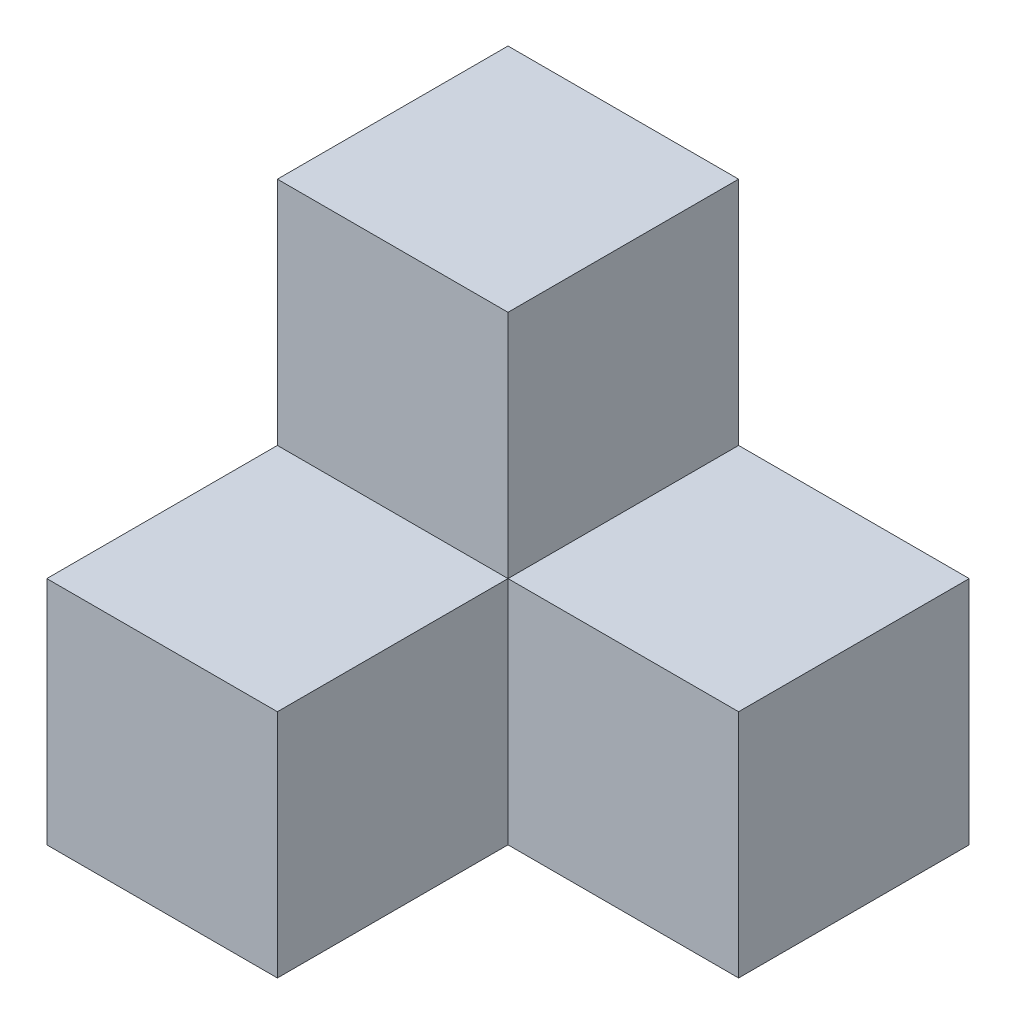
from build123d import *

# Parameters (mm, degrees)
BOSS_EXTRUDE1_DEPTH = 5
SKETCH2_W           = 5
SKETCH2_H           = 5
BOSS_EXTRUDE2_DEPTH = 5


with BuildPart() as part:
    # Sketch1 → Boss-Extrude1 (new body)
    with BuildSketch(Plane.XY):
        Polygon((0, 2.5), (5, 2.5), (5, -2.5), (-5, -2.5), (-5, 2.5), (-5, 7.5), (0, 7.5), align=None)
    extrude(amount=BOSS_EXTRUDE1_DEPTH)

    # Sketch2 → Boss-Extrude2 (add)
    with BuildSketch(Plane.XY.offset(5)):
        with Locations((-2.5, 0)):
            Rectangle(SKETCH2_W, SKETCH2_H)
    extrude(amount=BOSS_EXTRUDE2_DEPTH)


solid = part.part
